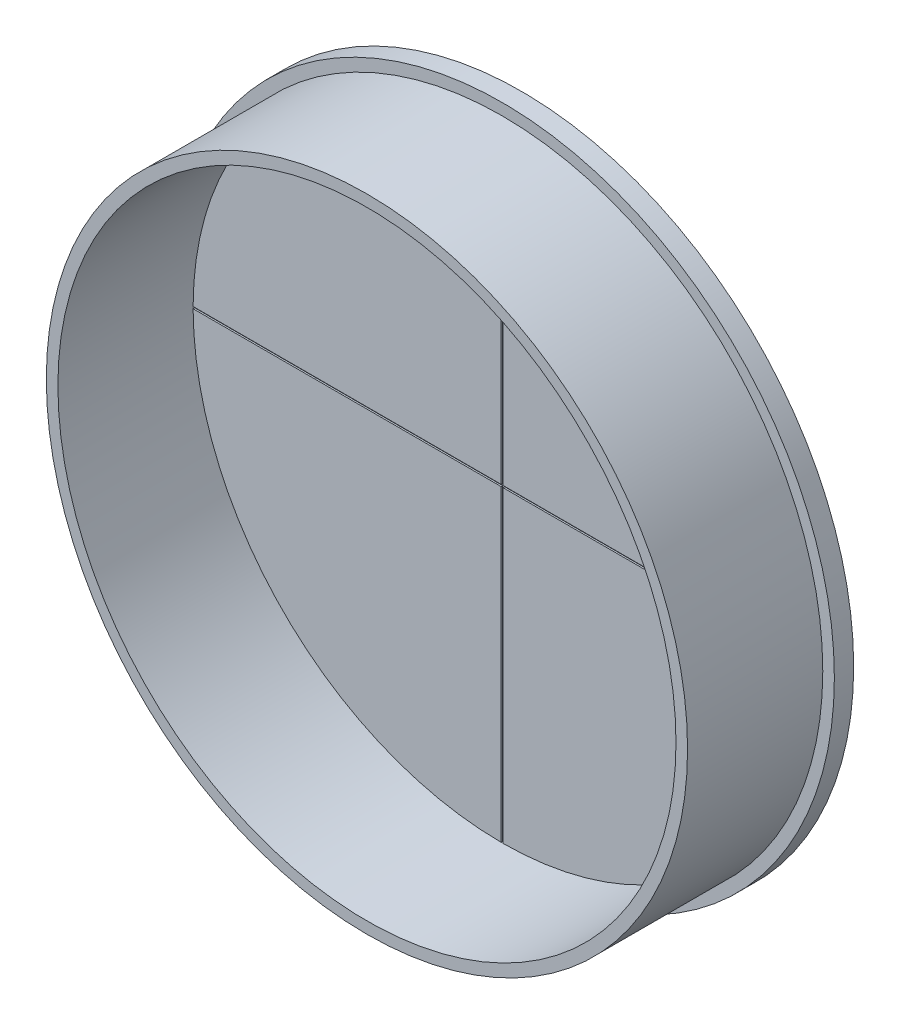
from build123d import *

# Parameters (mm, degrees)
SKETCH1_R           = 86
BOSS_EXTRUDE1_DEPTH = 5
SKETCH2_R           = 83
SKETCH2_R_2         = 80
BOSS_EXTRUDE2_DEPTH = 35
CUT_EXTRUDE1_DEPTH  = 0.4


with BuildPart() as part:
    # Sketch1 → Boss-Extrude1 (new body)
    with BuildSketch(Plane.XY):
        Circle(SKETCH1_R)
    extrude(amount=BOSS_EXTRUDE1_DEPTH)

    # Sketch2 → Boss-Extrude2 (add)
    with BuildSketch(Plane.XY.offset(5)):
        Circle(SKETCH2_R)
        Circle(SKETCH2_R_2, mode=Mode.SUBTRACT)
    extrude(amount=BOSS_EXTRUDE2_DEPTH)

    # Sketch3 → Cut-Extrude1 (cut)
    with BuildSketch(Plane.XY.offset(5)):
        Polygon((0.25, 0.25), (79.999609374, 0.25), (79.999609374, -0.25), (0.25, -0.25), (0.25, -79.999609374), (-0.25, -79.999609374), (-0.25, -0.25), (-79.999609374, -0.25), (-79.999609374, 0.25), (-0.25, 0.25), (-0.25, 79.999609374), (0.25, 79.999609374), align=None)
    extrude(amount=-CUT_EXTRUDE1_DEPTH, mode=Mode.SUBTRACT)


solid = part.part
